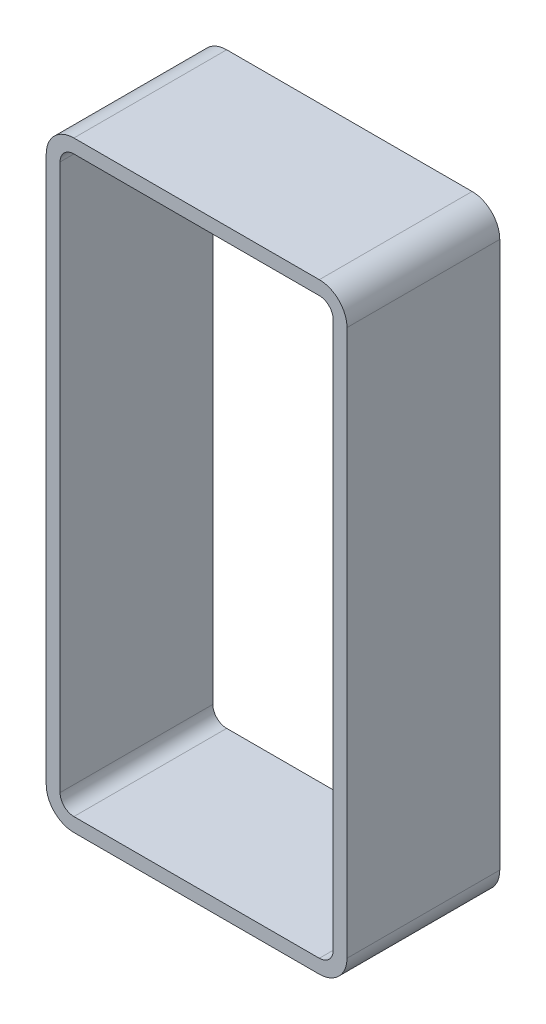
ISO-10303-21;
HEADER;
FILE_DESCRIPTION(('STEP AP214'),'2;1');
FILE_NAME('part.step','',(''),(''),'','','');
FILE_SCHEMA(('AUTOMOTIVE_DESIGN { 1 0 10303 214 1 1 1 1 }'));
ENDSEC;
DATA;
#1=APPLICATION_CONTEXT('core data for automotive mechanical design processes');
#2=APPLICATION_PROTOCOL_DEFINITION('international standard','automotive_design',2000,#1);
#3=PRODUCT_CONTEXT('',#1,'mechanical');
#4=PRODUCT('Part','Part','',(#3));
#5=PRODUCT_RELATED_PRODUCT_CATEGORY('part','',(#4));
#6=PRODUCT_DEFINITION_FORMATION('','',#4);
#7=PRODUCT_DEFINITION_CONTEXT('part definition',#1,'design');
#8=PRODUCT_DEFINITION('design','',#6,#7);
#9=PRODUCT_DEFINITION_SHAPE('','',#8);
#10=(LENGTH_UNIT() NAMED_UNIT(*) SI_UNIT(.MILLI.,.METRE.));
#11=(NAMED_UNIT(*) PLANE_ANGLE_UNIT() SI_UNIT($,.RADIAN.));
#12=(NAMED_UNIT(*) SI_UNIT($,.STERADIAN.) SOLID_ANGLE_UNIT());
#13=UNCERTAINTY_MEASURE_WITH_UNIT(LENGTH_MEASURE(1.E-05),#10,'distance_accuracy_value','');
#14=(GEOMETRIC_REPRESENTATION_CONTEXT(3) GLOBAL_UNCERTAINTY_ASSIGNED_CONTEXT((#13)) GLOBAL_UNIT_ASSIGNED_CONTEXT((#10,
#11,#12)) REPRESENTATION_CONTEXT('',''));
#15=CARTESIAN_POINT('',(0.,0.,0.));
#16=DIRECTION('',(0.,0.,1.));
#17=DIRECTION('',(1.,0.,0.));
#18=AXIS2_PLACEMENT_3D('',#15,#16,#17);
#19=CARTESIAN_POINT('',(-20.4,45.4,12.7));
#20=DIRECTION('',(0.,0.,-1.));
#21=DIRECTION('',(-1.,0.,0.));
#22=AXIS2_PLACEMENT_3D('',#19,#20,#21);
#23=PLANE('',#22);
#24=CARTESIAN_POINT('',(-20.4,45.4,12.7));
#25=DIRECTION('',(0.,0.,1.));
#26=DIRECTION('',(-1.,0.,0.));
#27=AXIS2_PLACEMENT_3D('',#24,#25,#26);
#28=CIRCLE('',#27,4.6);
#29=CARTESIAN_POINT('',(-20.4,50.,12.7));
#30=VERTEX_POINT('',#29);
#31=CARTESIAN_POINT('',(-25.,45.4,12.7));
#32=VERTEX_POINT('',#31);
#33=EDGE_CURVE('E220',#30,#32,#28,.T.);
#34=ORIENTED_EDGE('',*,*,#33,.T.);
#35=DIRECTION('',(0.,-1.,0.));
#36=VECTOR('',#35,1.);
#37=CARTESIAN_POINT('',(-25.,-45.4,12.7));
#38=LINE('',#37,#36);
#39=CARTESIAN_POINT('',(-25.,-45.4,12.7));
#40=VERTEX_POINT('',#39);
#41=EDGE_CURVE('E219',#32,#40,#38,.T.);
#42=ORIENTED_EDGE('',*,*,#41,.T.);
#43=CARTESIAN_POINT('',(-20.4,-45.4,12.7));
#44=DIRECTION('',(0.,0.,1.));
#45=DIRECTION('',(-1.,0.,0.));
#46=AXIS2_PLACEMENT_3D('',#43,#44,#45);
#47=CIRCLE('',#46,4.6);
#48=CARTESIAN_POINT('',(-20.4,-50.,12.7));
#49=VERTEX_POINT('',#48);
#50=EDGE_CURVE('E225',#40,#49,#47,.T.);
#51=ORIENTED_EDGE('',*,*,#50,.T.);
#52=DIRECTION('',(1.,0.,0.));
#53=VECTOR('',#52,1.);
#54=CARTESIAN_POINT('',(-20.4,-50.,12.7));
#55=LINE('',#54,#53);
#56=CARTESIAN_POINT('',(20.4,-50.,12.7));
#57=VERTEX_POINT('',#56);
#58=EDGE_CURVE('E222',#49,#57,#55,.T.);
#59=ORIENTED_EDGE('',*,*,#58,.T.);
#60=CARTESIAN_POINT('',(20.4,-45.4,12.7));
#61=DIRECTION('',(0.,0.,1.));
#62=DIRECTION('',(1.,0.,0.));
#63=AXIS2_PLACEMENT_3D('',#60,#61,#62);
#64=CIRCLE('',#63,4.6);
#65=CARTESIAN_POINT('',(25.,-45.4,12.7));
#66=VERTEX_POINT('',#65);
#67=EDGE_CURVE('E227',#57,#66,#64,.T.);
#68=ORIENTED_EDGE('',*,*,#67,.T.);
#69=DIRECTION('',(0.,1.,0.));
#70=VECTOR('',#69,1.);
#71=CARTESIAN_POINT('',(25.,-45.4,12.7));
#72=LINE('',#71,#70);
#73=CARTESIAN_POINT('',(25.,45.4,12.7));
#74=VERTEX_POINT('',#73);
#75=EDGE_CURVE('E230',#66,#74,#72,.T.);
#76=ORIENTED_EDGE('',*,*,#75,.T.);
#77=CARTESIAN_POINT('',(20.4,45.4,12.7));
#78=DIRECTION('',(0.,0.,1.));
#79=DIRECTION('',(-1.,0.,0.));
#80=AXIS2_PLACEMENT_3D('',#77,#78,#79);
#81=CIRCLE('',#80,4.6);
#82=CARTESIAN_POINT('',(20.4,50.,12.7));
#83=VERTEX_POINT('',#82);
#84=EDGE_CURVE('E233',#74,#83,#81,.T.);
#85=ORIENTED_EDGE('',*,*,#84,.T.);
#86=DIRECTION('',(-1.,0.,0.));
#87=VECTOR('',#86,1.);
#88=CARTESIAN_POINT('',(-20.4,50.,12.7));
#89=LINE('',#88,#87);
#90=EDGE_CURVE('E231',#83,#30,#89,.T.);
#91=ORIENTED_EDGE('',*,*,#90,.T.);
#92=EDGE_LOOP('',(#34,#42,#51,#59,#68,#76,#85,#91));
#93=FACE_BOUND('',#92,.T.);
#94=CARTESIAN_POINT('',(-20.4,45.4,12.7));
#95=DIRECTION('',(0.,0.,1.));
#96=DIRECTION('',(-1.,0.,0.));
#97=AXIS2_PLACEMENT_3D('',#94,#95,#96);
#98=CIRCLE('',#97,2.3);
#99=CARTESIAN_POINT('',(-20.4,47.7,12.7));
#100=VERTEX_POINT('',#99);
#101=CARTESIAN_POINT('',(-22.7,45.4,12.7));
#102=VERTEX_POINT('',#101);
#103=EDGE_CURVE('E155',#100,#102,#98,.T.);
#104=ORIENTED_EDGE('',*,*,#103,.F.);
#105=DIRECTION('',(-1.,0.,0.));
#106=VECTOR('',#105,1.);
#107=CARTESIAN_POINT('',(-20.4,47.7,12.7));
#108=LINE('',#107,#106);
#109=CARTESIAN_POINT('',(20.4,47.7,12.7));
#110=VERTEX_POINT('',#109);
#111=EDGE_CURVE('E184',#110,#100,#108,.T.);
#112=ORIENTED_EDGE('',*,*,#111,.F.);
#113=CARTESIAN_POINT('',(20.4,45.4,12.7));
#114=DIRECTION('',(0.,0.,1.));
#115=DIRECTION('',(-1.,0.,0.));
#116=AXIS2_PLACEMENT_3D('',#113,#114,#115);
#117=CIRCLE('',#116,2.3);
#118=CARTESIAN_POINT('',(22.7,45.4,12.7));
#119=VERTEX_POINT('',#118);
#120=EDGE_CURVE('E182',#119,#110,#117,.T.);
#121=ORIENTED_EDGE('',*,*,#120,.F.);
#122=DIRECTION('',(0.,1.,0.));
#123=VECTOR('',#122,1.);
#124=CARTESIAN_POINT('',(22.7,-45.4,12.7));
#125=LINE('',#124,#123);
#126=CARTESIAN_POINT('',(22.7,-45.4,12.7));
#127=VERTEX_POINT('',#126);
#128=EDGE_CURVE('E181',#127,#119,#125,.T.);
#129=ORIENTED_EDGE('',*,*,#128,.F.);
#130=CARTESIAN_POINT('',(20.4,-45.4,12.7));
#131=DIRECTION('',(0.,0.,1.));
#132=DIRECTION('',(1.,0.,0.));
#133=AXIS2_PLACEMENT_3D('',#130,#131,#132);
#134=CIRCLE('',#133,2.3);
#135=CARTESIAN_POINT('',(20.4,-47.7,12.7));
#136=VERTEX_POINT('',#135);
#137=EDGE_CURVE('E177',#136,#127,#134,.T.);
#138=ORIENTED_EDGE('',*,*,#137,.F.);
#139=DIRECTION('',(1.,0.,0.));
#140=VECTOR('',#139,1.);
#141=CARTESIAN_POINT('',(-20.4,-47.7,12.7));
#142=LINE('',#141,#140);
#143=CARTESIAN_POINT('',(-20.4,-47.7,12.7));
#144=VERTEX_POINT('',#143);
#145=EDGE_CURVE('E174',#144,#136,#142,.T.);
#146=ORIENTED_EDGE('',*,*,#145,.F.);
#147=CARTESIAN_POINT('',(-20.4,-45.4,12.7));
#148=DIRECTION('',(0.,0.,1.));
#149=DIRECTION('',(-1.,0.,0.));
#150=AXIS2_PLACEMENT_3D('',#147,#148,#149);
#151=CIRCLE('',#150,2.3);
#152=CARTESIAN_POINT('',(-22.7,-45.4,12.7));
#153=VERTEX_POINT('',#152);
#154=EDGE_CURVE('E173',#153,#144,#151,.T.);
#155=ORIENTED_EDGE('',*,*,#154,.F.);
#156=DIRECTION('',(0.,-1.,0.));
#157=VECTOR('',#156,1.);
#158=CARTESIAN_POINT('',(-22.7,-45.4,12.7));
#159=LINE('',#158,#157);
#160=EDGE_CURVE('E157',#102,#153,#159,.T.);
#161=ORIENTED_EDGE('',*,*,#160,.F.);
#162=EDGE_LOOP('',(#104,#112,#121,#129,#138,#146,#155,#161));
#163=FACE_BOUND('',#162,.T.);
#164=ADVANCED_FACE('F39',(#93,#163),#23,.F.);
#165=CARTESIAN_POINT('',(-20.4,45.4,-12.7));
#166=DIRECTION('',(0.,0.,-1.));
#167=DIRECTION('',(-1.,0.,0.));
#168=AXIS2_PLACEMENT_3D('',#165,#166,#167);
#169=PLANE('',#168);
#170=CARTESIAN_POINT('',(-20.4,45.4,-12.7));
#171=DIRECTION('',(0.,0.,1.));
#172=DIRECTION('',(-1.,0.,0.));
#173=AXIS2_PLACEMENT_3D('',#170,#171,#172);
#174=CIRCLE('',#173,4.6);
#175=CARTESIAN_POINT('',(-20.4,50.,-12.7));
#176=VERTEX_POINT('',#175);
#177=CARTESIAN_POINT('',(-25.,45.4,-12.7));
#178=VERTEX_POINT('',#177);
#179=EDGE_CURVE('E166',#176,#178,#174,.T.);
#180=ORIENTED_EDGE('',*,*,#179,.F.);
#181=DIRECTION('',(-1.,0.,0.));
#182=VECTOR('',#181,1.);
#183=CARTESIAN_POINT('',(-20.4,50.,-12.7));
#184=LINE('',#183,#182);
#185=CARTESIAN_POINT('',(20.4,50.,-12.7));
#186=VERTEX_POINT('',#185);
#187=EDGE_CURVE('E224',#186,#176,#184,.T.);
#188=ORIENTED_EDGE('',*,*,#187,.F.);
#189=CARTESIAN_POINT('',(20.4,45.4,-12.7));
#190=DIRECTION('',(0.,0.,1.));
#191=DIRECTION('',(-1.,0.,0.));
#192=AXIS2_PLACEMENT_3D('',#189,#190,#191);
#193=CIRCLE('',#192,4.6);
#194=CARTESIAN_POINT('',(25.,45.4,-12.7));
#195=VERTEX_POINT('',#194);
#196=EDGE_CURVE('E247',#195,#186,#193,.T.);
#197=ORIENTED_EDGE('',*,*,#196,.F.);
#198=DIRECTION('',(0.,1.,0.));
#199=VECTOR('',#198,1.);
#200=CARTESIAN_POINT('',(25.,-45.4,-12.7));
#201=LINE('',#200,#199);
#202=CARTESIAN_POINT('',(25.,-45.4,-12.7));
#203=VERTEX_POINT('',#202);
#204=EDGE_CURVE('E246',#203,#195,#201,.T.);
#205=ORIENTED_EDGE('',*,*,#204,.F.);
#206=CARTESIAN_POINT('',(20.4,-45.4,-12.7));
#207=DIRECTION('',(0.,0.,1.));
#208=DIRECTION('',(1.,0.,0.));
#209=AXIS2_PLACEMENT_3D('',#206,#207,#208);
#210=CIRCLE('',#209,4.6);
#211=CARTESIAN_POINT('',(20.4,-50.,-12.7));
#212=VERTEX_POINT('',#211);
#213=EDGE_CURVE('E242',#212,#203,#210,.T.);
#214=ORIENTED_EDGE('',*,*,#213,.F.);
#215=DIRECTION('',(1.,0.,0.));
#216=VECTOR('',#215,1.);
#217=CARTESIAN_POINT('',(-20.4,-50.,-12.7));
#218=LINE('',#217,#216);
#219=CARTESIAN_POINT('',(-20.4,-50.,-12.7));
#220=VERTEX_POINT('',#219);
#221=EDGE_CURVE('E245',#220,#212,#218,.T.);
#222=ORIENTED_EDGE('',*,*,#221,.F.);
#223=CARTESIAN_POINT('',(-20.4,-45.4,-12.7));
#224=DIRECTION('',(0.,0.,1.));
#225=DIRECTION('',(-1.,0.,0.));
#226=AXIS2_PLACEMENT_3D('',#223,#224,#225);
#227=CIRCLE('',#226,4.6);
#228=CARTESIAN_POINT('',(-25.,-45.4,-12.7));
#229=VERTEX_POINT('',#228);
#230=EDGE_CURVE('E239',#229,#220,#227,.T.);
#231=ORIENTED_EDGE('',*,*,#230,.F.);
#232=DIRECTION('',(0.,-1.,0.));
#233=VECTOR('',#232,1.);
#234=CARTESIAN_POINT('',(-25.,-45.4,-12.7));
#235=LINE('',#234,#233);
#236=EDGE_CURVE('E238',#178,#229,#235,.T.);
#237=ORIENTED_EDGE('',*,*,#236,.F.);
#238=EDGE_LOOP('',(#180,#188,#197,#205,#214,#222,#231,#237));
#239=FACE_BOUND('',#238,.T.);
#240=DIRECTION('',(-1.,0.,0.));
#241=VECTOR('',#240,1.);
#242=CARTESIAN_POINT('',(-20.4,47.7,-12.7));
#243=LINE('',#242,#241);
#244=CARTESIAN_POINT('',(20.4,47.7,-12.7));
#245=VERTEX_POINT('',#244);
#246=CARTESIAN_POINT('',(-20.4,47.7,-12.7));
#247=VERTEX_POINT('',#246);
#248=EDGE_CURVE('E163',#245,#247,#243,.T.);
#249=ORIENTED_EDGE('',*,*,#248,.T.);
#250=CARTESIAN_POINT('',(-20.4,45.4,-12.7));
#251=DIRECTION('',(0.,0.,1.));
#252=DIRECTION('',(-1.,0.,0.));
#253=AXIS2_PLACEMENT_3D('',#250,#251,#252);
#254=CIRCLE('',#253,2.3);
#255=CARTESIAN_POINT('',(-22.7,45.4,-12.7));
#256=VERTEX_POINT('',#255);
#257=EDGE_CURVE('E61',#247,#256,#254,.T.);
#258=ORIENTED_EDGE('',*,*,#257,.T.);
#259=DIRECTION('',(0.,-1.,0.));
#260=VECTOR('',#259,1.);
#261=CARTESIAN_POINT('',(-22.7,-45.4,-12.7));
#262=LINE('',#261,#260);
#263=CARTESIAN_POINT('',(-22.7,-45.4,-12.7));
#264=VERTEX_POINT('',#263);
#265=EDGE_CURVE('E170',#256,#264,#262,.T.);
#266=ORIENTED_EDGE('',*,*,#265,.T.);
#267=CARTESIAN_POINT('',(-20.4,-45.4,-12.7));
#268=DIRECTION('',(0.,0.,1.));
#269=DIRECTION('',(-1.,0.,0.));
#270=AXIS2_PLACEMENT_3D('',#267,#268,#269);
#271=CIRCLE('',#270,2.3);
#272=CARTESIAN_POINT('',(-20.4,-47.7,-12.7));
#273=VERTEX_POINT('',#272);
#274=EDGE_CURVE('E186',#264,#273,#271,.T.);
#275=ORIENTED_EDGE('',*,*,#274,.T.);
#276=DIRECTION('',(1.,0.,0.));
#277=VECTOR('',#276,1.);
#278=CARTESIAN_POINT('',(-20.4,-47.7,-12.7));
#279=LINE('',#278,#277);
#280=CARTESIAN_POINT('',(20.4,-47.7,-12.7));
#281=VERTEX_POINT('',#280);
#282=EDGE_CURVE('E191',#273,#281,#279,.T.);
#283=ORIENTED_EDGE('',*,*,#282,.T.);
#284=CARTESIAN_POINT('',(20.4,-45.4,-12.7));
#285=DIRECTION('',(0.,0.,1.));
#286=DIRECTION('',(1.,0.,0.));
#287=AXIS2_PLACEMENT_3D('',#284,#285,#286);
#288=CIRCLE('',#287,2.3);
#289=CARTESIAN_POINT('',(22.7,-45.4,-12.7));
#290=VERTEX_POINT('',#289);
#291=EDGE_CURVE('E192',#281,#290,#288,.T.);
#292=ORIENTED_EDGE('',*,*,#291,.T.);
#293=DIRECTION('',(0.,1.,0.));
#294=VECTOR('',#293,1.);
#295=CARTESIAN_POINT('',(22.7,-45.4,-12.7));
#296=LINE('',#295,#294);
#297=CARTESIAN_POINT('',(22.7,45.4,-12.7));
#298=VERTEX_POINT('',#297);
#299=EDGE_CURVE('E198',#290,#298,#296,.T.);
#300=ORIENTED_EDGE('',*,*,#299,.T.);
#301=CARTESIAN_POINT('',(20.4,45.4,-12.7));
#302=DIRECTION('',(0.,0.,1.));
#303=DIRECTION('',(-1.,0.,0.));
#304=AXIS2_PLACEMENT_3D('',#301,#302,#303);
#305=CIRCLE('',#304,2.3);
#306=EDGE_CURVE('E204',#298,#245,#305,.T.);
#307=ORIENTED_EDGE('',*,*,#306,.T.);
#308=EDGE_LOOP('',(#249,#258,#266,#275,#283,#292,#300,#307));
#309=FACE_BOUND('',#308,.T.);
#310=ADVANCED_FACE('F280',(#239,#309),#169,.T.);
#311=CARTESIAN_POINT('',(-20.4,45.4,12.7));
#312=DIRECTION('',(0.,0.,-1.));
#313=DIRECTION('',(-1.,0.,0.));
#314=AXIS2_PLACEMENT_3D('',#311,#312,#313);
#315=CYLINDRICAL_SURFACE('',#314,4.6);
#316=ORIENTED_EDGE('',*,*,#179,.T.);
#317=DIRECTION('',(0.,0.,-1.));
#318=VECTOR('',#317,1.);
#319=CARTESIAN_POINT('',(-25.,45.4,12.7));
#320=LINE('',#319,#318);
#321=EDGE_CURVE('E11',#32,#178,#320,.T.);
#322=ORIENTED_EDGE('',*,*,#321,.F.);
#323=ORIENTED_EDGE('',*,*,#33,.F.);
#324=DIRECTION('',(0.,0.,-1.));
#325=VECTOR('',#324,1.);
#326=CARTESIAN_POINT('',(-20.4,50.,12.7));
#327=LINE('',#326,#325);
#328=EDGE_CURVE('E232',#30,#176,#327,.T.);
#329=ORIENTED_EDGE('',*,*,#328,.T.);
#330=EDGE_LOOP('',(#316,#322,#323,#329));
#331=FACE_BOUND('',#330,.T.);
#332=ADVANCED_FACE('F41',(#331),#315,.T.);
#333=CARTESIAN_POINT('',(-25.,-45.4,12.7));
#334=DIRECTION('',(1.,0.,0.));
#335=DIRECTION('',(0.,0.,-1.));
#336=AXIS2_PLACEMENT_3D('',#333,#334,#335);
#337=PLANE('',#336);
#338=ORIENTED_EDGE('',*,*,#236,.T.);
#339=DIRECTION('',(0.,0.,-1.));
#340=VECTOR('',#339,1.);
#341=CARTESIAN_POINT('',(-25.,-45.4,12.7));
#342=LINE('',#341,#340);
#343=EDGE_CURVE('E50',#40,#229,#342,.T.);
#344=ORIENTED_EDGE('',*,*,#343,.F.);
#345=ORIENTED_EDGE('',*,*,#41,.F.);
#346=ORIENTED_EDGE('',*,*,#321,.T.);
#347=EDGE_LOOP('',(#338,#344,#345,#346));
#348=FACE_BOUND('',#347,.T.);
#349=ADVANCED_FACE('F294',(#348),#337,.F.);
#350=CARTESIAN_POINT('',(-20.4,-45.4,12.7));
#351=DIRECTION('',(0.,0.,-1.));
#352=DIRECTION('',(-1.,0.,0.));
#353=AXIS2_PLACEMENT_3D('',#350,#351,#352);
#354=CYLINDRICAL_SURFACE('',#353,4.6);
#355=ORIENTED_EDGE('',*,*,#230,.T.);
#356=DIRECTION('',(0.,0.,-1.));
#357=VECTOR('',#356,1.);
#358=CARTESIAN_POINT('',(-20.4,-50.,12.7));
#359=LINE('',#358,#357);
#360=EDGE_CURVE('E264',#49,#220,#359,.T.);
#361=ORIENTED_EDGE('',*,*,#360,.F.);
#362=ORIENTED_EDGE('',*,*,#50,.F.);
#363=ORIENTED_EDGE('',*,*,#343,.T.);
#364=EDGE_LOOP('',(#355,#361,#362,#363));
#365=FACE_BOUND('',#364,.T.);
#366=ADVANCED_FACE('F275',(#365),#354,.T.);
#367=CARTESIAN_POINT('',(-20.4,-50.,12.7));
#368=DIRECTION('',(0.,1.,0.));
#369=DIRECTION('',(0.,0.,1.));
#370=AXIS2_PLACEMENT_3D('',#367,#368,#369);
#371=PLANE('',#370);
#372=ORIENTED_EDGE('',*,*,#221,.T.);
#373=DIRECTION('',(0.,0.,-1.));
#374=VECTOR('',#373,1.);
#375=CARTESIAN_POINT('',(20.4,-50.,12.7));
#376=LINE('',#375,#374);
#377=EDGE_CURVE('E265',#57,#212,#376,.T.);
#378=ORIENTED_EDGE('',*,*,#377,.F.);
#379=ORIENTED_EDGE('',*,*,#58,.F.);
#380=ORIENTED_EDGE('',*,*,#360,.T.);
#381=EDGE_LOOP('',(#372,#378,#379,#380));
#382=FACE_BOUND('',#381,.T.);
#383=ADVANCED_FACE('F282',(#382),#371,.F.);
#384=CARTESIAN_POINT('',(20.4,-45.4,12.7));
#385=DIRECTION('',(0.,0.,-1.));
#386=DIRECTION('',(-1.,0.,0.));
#387=AXIS2_PLACEMENT_3D('',#384,#385,#386);
#388=CYLINDRICAL_SURFACE('',#387,4.6);
#389=ORIENTED_EDGE('',*,*,#213,.T.);
#390=DIRECTION('',(0.,0.,-1.));
#391=VECTOR('',#390,1.);
#392=CARTESIAN_POINT('',(25.,-45.4,12.7));
#393=LINE('',#392,#391);
#394=EDGE_CURVE('E258',#66,#203,#393,.T.);
#395=ORIENTED_EDGE('',*,*,#394,.F.);
#396=ORIENTED_EDGE('',*,*,#67,.F.);
#397=ORIENTED_EDGE('',*,*,#377,.T.);
#398=EDGE_LOOP('',(#389,#395,#396,#397));
#399=FACE_BOUND('',#398,.T.);
#400=ADVANCED_FACE('F290',(#399),#388,.T.);
#401=CARTESIAN_POINT('',(25.,-45.4,12.7));
#402=DIRECTION('',(-1.,0.,0.));
#403=DIRECTION('',(0.,0.,1.));
#404=AXIS2_PLACEMENT_3D('',#401,#402,#403);
#405=PLANE('',#404);
#406=ORIENTED_EDGE('',*,*,#204,.T.);
#407=DIRECTION('',(0.,0.,-1.));
#408=VECTOR('',#407,1.);
#409=CARTESIAN_POINT('',(25.,45.4,12.7));
#410=LINE('',#409,#408);
#411=EDGE_CURVE('E259',#74,#195,#410,.T.);
#412=ORIENTED_EDGE('',*,*,#411,.F.);
#413=ORIENTED_EDGE('',*,*,#75,.F.);
#414=ORIENTED_EDGE('',*,*,#394,.T.);
#415=EDGE_LOOP('',(#406,#412,#413,#414));
#416=FACE_BOUND('',#415,.T.);
#417=ADVANCED_FACE('F308',(#416),#405,.F.);
#418=CARTESIAN_POINT('',(20.4,45.4,12.7));
#419=DIRECTION('',(0.,0.,-1.));
#420=DIRECTION('',(-1.,0.,0.));
#421=AXIS2_PLACEMENT_3D('',#418,#419,#420);
#422=CYLINDRICAL_SURFACE('',#421,4.6);
#423=ORIENTED_EDGE('',*,*,#196,.T.);
#424=DIRECTION('',(0.,0.,-1.));
#425=VECTOR('',#424,1.);
#426=CARTESIAN_POINT('',(20.4,50.,12.7));
#427=LINE('',#426,#425);
#428=EDGE_CURVE('E254',#83,#186,#427,.T.);
#429=ORIENTED_EDGE('',*,*,#428,.F.);
#430=ORIENTED_EDGE('',*,*,#84,.F.);
#431=ORIENTED_EDGE('',*,*,#411,.T.);
#432=EDGE_LOOP('',(#423,#429,#430,#431));
#433=FACE_BOUND('',#432,.T.);
#434=ADVANCED_FACE('F306',(#433),#422,.T.);
#435=CARTESIAN_POINT('',(-20.4,50.,12.7));
#436=DIRECTION('',(0.,-1.,0.));
#437=DIRECTION('',(0.,0.,-1.));
#438=AXIS2_PLACEMENT_3D('',#435,#436,#437);
#439=PLANE('',#438);
#440=ORIENTED_EDGE('',*,*,#187,.T.);
#441=ORIENTED_EDGE('',*,*,#328,.F.);
#442=ORIENTED_EDGE('',*,*,#90,.F.);
#443=ORIENTED_EDGE('',*,*,#428,.T.);
#444=EDGE_LOOP('',(#440,#441,#442,#443));
#445=FACE_BOUND('',#444,.T.);
#446=ADVANCED_FACE('F301',(#445),#439,.F.);
#447=CARTESIAN_POINT('',(-20.4,45.4,12.7));
#448=DIRECTION('',(0.,0.,-1.));
#449=DIRECTION('',(-1.,0.,0.));
#450=AXIS2_PLACEMENT_3D('',#447,#448,#449);
#451=CYLINDRICAL_SURFACE('',#450,2.3);
#452=ORIENTED_EDGE('',*,*,#257,.F.);
#453=DIRECTION('',(0.,0.,-1.));
#454=VECTOR('',#453,1.);
#455=CARTESIAN_POINT('',(-20.4,47.7,12.7));
#456=LINE('',#455,#454);
#457=EDGE_CURVE('E159',#100,#247,#456,.T.);
#458=ORIENTED_EDGE('',*,*,#457,.F.);
#459=ORIENTED_EDGE('',*,*,#103,.T.);
#460=DIRECTION('',(0.,0.,-1.));
#461=VECTOR('',#460,1.);
#462=CARTESIAN_POINT('',(-22.7,45.4,12.7));
#463=LINE('',#462,#461);
#464=EDGE_CURVE('E154',#102,#256,#463,.T.);
#465=ORIENTED_EDGE('',*,*,#464,.T.);
#466=EDGE_LOOP('',(#452,#458,#459,#465));
#467=FACE_BOUND('',#466,.T.);
#468=ADVANCED_FACE('F152',(#467),#451,.F.);
#469=CARTESIAN_POINT('',(-22.7,-45.4,12.7));
#470=DIRECTION('',(1.,0.,0.));
#471=DIRECTION('',(0.,0.,-1.));
#472=AXIS2_PLACEMENT_3D('',#469,#470,#471);
#473=PLANE('',#472);
#474=ORIENTED_EDGE('',*,*,#265,.F.);
#475=ORIENTED_EDGE('',*,*,#464,.F.);
#476=ORIENTED_EDGE('',*,*,#160,.T.);
#477=DIRECTION('',(0.,0.,-1.));
#478=VECTOR('',#477,1.);
#479=CARTESIAN_POINT('',(-22.7,-45.4,12.7));
#480=LINE('',#479,#478);
#481=EDGE_CURVE('E169',#153,#264,#480,.T.);
#482=ORIENTED_EDGE('',*,*,#481,.T.);
#483=EDGE_LOOP('',(#474,#475,#476,#482));
#484=FACE_BOUND('',#483,.T.);
#485=ADVANCED_FACE('F165',(#484),#473,.T.);
#486=CARTESIAN_POINT('',(-20.4,-45.4,12.7));
#487=DIRECTION('',(0.,0.,-1.));
#488=DIRECTION('',(-1.,0.,0.));
#489=AXIS2_PLACEMENT_3D('',#486,#487,#488);
#490=CYLINDRICAL_SURFACE('',#489,2.3);
#491=ORIENTED_EDGE('',*,*,#274,.F.);
#492=ORIENTED_EDGE('',*,*,#481,.F.);
#493=ORIENTED_EDGE('',*,*,#154,.T.);
#494=DIRECTION('',(0.,0.,-1.));
#495=VECTOR('',#494,1.);
#496=CARTESIAN_POINT('',(-20.4,-47.7,12.7));
#497=LINE('',#496,#495);
#498=EDGE_CURVE('E213',#144,#273,#497,.T.);
#499=ORIENTED_EDGE('',*,*,#498,.T.);
#500=EDGE_LOOP('',(#491,#492,#493,#499));
#501=FACE_BOUND('',#500,.T.);
#502=ADVANCED_FACE('F335',(#501),#490,.F.);
#503=CARTESIAN_POINT('',(-20.4,-47.7,12.7));
#504=DIRECTION('',(0.,1.,0.));
#505=DIRECTION('',(0.,0.,1.));
#506=AXIS2_PLACEMENT_3D('',#503,#504,#505);
#507=PLANE('',#506);
#508=ORIENTED_EDGE('',*,*,#282,.F.);
#509=ORIENTED_EDGE('',*,*,#498,.F.);
#510=ORIENTED_EDGE('',*,*,#145,.T.);
#511=DIRECTION('',(0.,0.,-1.));
#512=VECTOR('',#511,1.);
#513=CARTESIAN_POINT('',(20.4,-47.7,12.7));
#514=LINE('',#513,#512);
#515=EDGE_CURVE('E211',#136,#281,#514,.T.);
#516=ORIENTED_EDGE('',*,*,#515,.T.);
#517=EDGE_LOOP('',(#508,#509,#510,#516));
#518=FACE_BOUND('',#517,.T.);
#519=ADVANCED_FACE('F340',(#518),#507,.T.);
#520=CARTESIAN_POINT('',(20.4,-45.4,12.7));
#521=DIRECTION('',(0.,0.,-1.));
#522=DIRECTION('',(-1.,0.,0.));
#523=AXIS2_PLACEMENT_3D('',#520,#521,#522);
#524=CYLINDRICAL_SURFACE('',#523,2.3);
#525=ORIENTED_EDGE('',*,*,#291,.F.);
#526=ORIENTED_EDGE('',*,*,#515,.F.);
#527=ORIENTED_EDGE('',*,*,#137,.T.);
#528=DIRECTION('',(0.,0.,-1.));
#529=VECTOR('',#528,1.);
#530=CARTESIAN_POINT('',(22.7,-45.4,12.7));
#531=LINE('',#530,#529);
#532=EDGE_CURVE('E208',#127,#290,#531,.T.);
#533=ORIENTED_EDGE('',*,*,#532,.T.);
#534=EDGE_LOOP('',(#525,#526,#527,#533));
#535=FACE_BOUND('',#534,.T.);
#536=ADVANCED_FACE('F345',(#535),#524,.F.);
#537=CARTESIAN_POINT('',(22.7,-45.4,12.7));
#538=DIRECTION('',(-1.,0.,0.));
#539=DIRECTION('',(0.,0.,1.));
#540=AXIS2_PLACEMENT_3D('',#537,#538,#539);
#541=PLANE('',#540);
#542=ORIENTED_EDGE('',*,*,#299,.F.);
#543=ORIENTED_EDGE('',*,*,#532,.F.);
#544=ORIENTED_EDGE('',*,*,#128,.T.);
#545=DIRECTION('',(0.,0.,-1.));
#546=VECTOR('',#545,1.);
#547=CARTESIAN_POINT('',(22.7,45.4,12.7));
#548=LINE('',#547,#546);
#549=EDGE_CURVE('E206',#119,#298,#548,.T.);
#550=ORIENTED_EDGE('',*,*,#549,.T.);
#551=EDGE_LOOP('',(#542,#543,#544,#550));
#552=FACE_BOUND('',#551,.T.);
#553=ADVANCED_FACE('F350',(#552),#541,.T.);
#554=CARTESIAN_POINT('',(20.4,45.4,12.7));
#555=DIRECTION('',(0.,0.,-1.));
#556=DIRECTION('',(-1.,0.,0.));
#557=AXIS2_PLACEMENT_3D('',#554,#555,#556);
#558=CYLINDRICAL_SURFACE('',#557,2.3);
#559=ORIENTED_EDGE('',*,*,#306,.F.);
#560=ORIENTED_EDGE('',*,*,#549,.F.);
#561=ORIENTED_EDGE('',*,*,#120,.T.);
#562=DIRECTION('',(0.,0.,-1.));
#563=VECTOR('',#562,1.);
#564=CARTESIAN_POINT('',(20.4,47.7,12.7));
#565=LINE('',#564,#563);
#566=EDGE_CURVE('E53',#110,#245,#565,.T.);
#567=ORIENTED_EDGE('',*,*,#566,.T.);
#568=EDGE_LOOP('',(#559,#560,#561,#567));
#569=FACE_BOUND('',#568,.T.);
#570=ADVANCED_FACE('F354',(#569),#558,.F.);
#571=CARTESIAN_POINT('',(-20.4,47.7,12.7));
#572=DIRECTION('',(0.,-1.,0.));
#573=DIRECTION('',(0.,0.,-1.));
#574=AXIS2_PLACEMENT_3D('',#571,#572,#573);
#575=PLANE('',#574);
#576=ORIENTED_EDGE('',*,*,#248,.F.);
#577=ORIENTED_EDGE('',*,*,#566,.F.);
#578=ORIENTED_EDGE('',*,*,#111,.T.);
#579=ORIENTED_EDGE('',*,*,#457,.T.);
#580=EDGE_LOOP('',(#576,#577,#578,#579));
#581=FACE_BOUND('',#580,.T.);
#582=ADVANCED_FACE('F352',(#581),#575,.T.);
#583=CLOSED_SHELL('',(#164,#310,#332,#349,#366,#383,#400,#417,#434,#446,#468,#485,#502,#519,
#536,#553,#570,#582));
#584=MANIFOLD_SOLID_BREP('B2',#583);
#585=ADVANCED_BREP_SHAPE_REPRESENTATION('',(#18,#584),#14);
#586=SHAPE_DEFINITION_REPRESENTATION(#9,#585);
ENDSEC;
END-ISO-10303-21;
